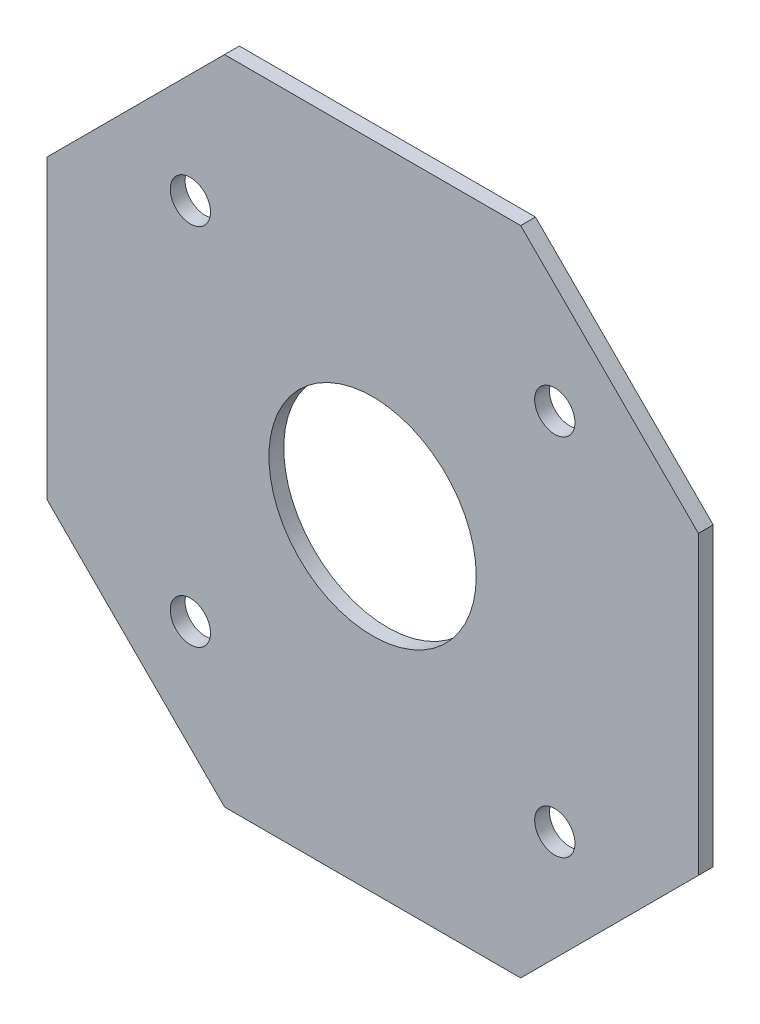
ISO-10303-21;
HEADER;
FILE_DESCRIPTION(('STEP AP214'),'2;1');
FILE_NAME('part.step','',(''),(''),'','','');
FILE_SCHEMA(('AUTOMOTIVE_DESIGN { 1 0 10303 214 1 1 1 1 }'));
ENDSEC;
DATA;
#1=APPLICATION_CONTEXT('core data for automotive mechanical design processes');
#2=APPLICATION_PROTOCOL_DEFINITION('international standard','automotive_design',2000,#1);
#3=PRODUCT_CONTEXT('',#1,'mechanical');
#4=PRODUCT('Part','Part','',(#3));
#5=PRODUCT_RELATED_PRODUCT_CATEGORY('part','',(#4));
#6=PRODUCT_DEFINITION_FORMATION('','',#4);
#7=PRODUCT_DEFINITION_CONTEXT('part definition',#1,'design');
#8=PRODUCT_DEFINITION('design','',#6,#7);
#9=PRODUCT_DEFINITION_SHAPE('','',#8);
#10=(LENGTH_UNIT() NAMED_UNIT(*) SI_UNIT(.MILLI.,.METRE.));
#11=(NAMED_UNIT(*) PLANE_ANGLE_UNIT() SI_UNIT($,.RADIAN.));
#12=(NAMED_UNIT(*) SI_UNIT($,.STERADIAN.) SOLID_ANGLE_UNIT());
#13=UNCERTAINTY_MEASURE_WITH_UNIT(LENGTH_MEASURE(1.E-05),#10,'distance_accuracy_value','');
#14=(GEOMETRIC_REPRESENTATION_CONTEXT(3) GLOBAL_UNCERTAINTY_ASSIGNED_CONTEXT((#13)) GLOBAL_UNIT_ASSIGNED_CONTEXT((#10,
#11,#12)) REPRESENTATION_CONTEXT('',''));
#15=CARTESIAN_POINT('',(0.,0.,0.));
#16=DIRECTION('',(0.,0.,1.));
#17=DIRECTION('',(1.,0.,0.));
#18=AXIS2_PLACEMENT_3D('',#15,#16,#17);
#19=CARTESIAN_POINT('',(-55.,55.,0.));
#20=DIRECTION('',(0.,0.,-1.));
#21=DIRECTION('',(-1.,0.,0.));
#22=AXIS2_PLACEMENT_3D('',#19,#20,#21);
#23=PLANE('',#22);
#24=CARTESIAN_POINT('',(-30.7591449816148,30.7591449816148,0.));
#25=DIRECTION('',(0.,0.,1.));
#26=DIRECTION('',(1.,0.,0.));
#27=AXIS2_PLACEMENT_3D('',#24,#25,#26);
#28=CIRCLE('',#27,3.4);
#29=CARTESIAN_POINT('',(-27.3591449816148,30.7591449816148,0.));
#30=VERTEX_POINT('',#29);
#31=EDGE_CURVE('E197',#30,#30,#28,.T.);
#32=ORIENTED_EDGE('',*,*,#31,.T.);
#33=EDGE_LOOP('',(#32));
#34=FACE_BOUND('',#33,.T.);
#35=CARTESIAN_POINT('',(-30.7591449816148,-30.7591449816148,0.));
#36=DIRECTION('',(0.,0.,1.));
#37=DIRECTION('',(1.,0.,0.));
#38=AXIS2_PLACEMENT_3D('',#35,#36,#37);
#39=CIRCLE('',#38,3.4);
#40=CARTESIAN_POINT('',(-27.3591449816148,-30.7591449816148,0.));
#41=VERTEX_POINT('',#40);
#42=EDGE_CURVE('E205',#41,#41,#39,.T.);
#43=ORIENTED_EDGE('',*,*,#42,.T.);
#44=EDGE_LOOP('',(#43));
#45=FACE_BOUND('',#44,.T.);
#46=CARTESIAN_POINT('',(30.7591449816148,-30.7591449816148,0.));
#47=DIRECTION('',(0.,0.,1.));
#48=DIRECTION('',(1.,0.,0.));
#49=AXIS2_PLACEMENT_3D('',#46,#47,#48);
#50=CIRCLE('',#49,3.4);
#51=CARTESIAN_POINT('',(34.1591449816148,-30.7591449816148,0.));
#52=VERTEX_POINT('',#51);
#53=EDGE_CURVE('E204',#52,#52,#50,.T.);
#54=ORIENTED_EDGE('',*,*,#53,.T.);
#55=EDGE_LOOP('',(#54));
#56=FACE_BOUND('',#55,.T.);
#57=DIRECTION('',(0.,1.,0.));
#58=VECTOR('',#57,1.);
#59=CARTESIAN_POINT('',(55.,-55.,0.));
#60=LINE('',#59,#58);
#61=CARTESIAN_POINT('',(55.,-25.,0.));
#62=VERTEX_POINT('',#61);
#63=CARTESIAN_POINT('',(55.,25.,0.));
#64=VERTEX_POINT('',#63);
#65=EDGE_CURVE('E134',#62,#64,#60,.T.);
#66=ORIENTED_EDGE('',*,*,#65,.F.);
#67=DIRECTION('',(0.707106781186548,0.707106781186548,0.));
#68=VECTOR('',#67,1.);
#69=CARTESIAN_POINT('',(40.,-39.9999999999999,0.));
#70=LINE('',#69,#68);
#71=CARTESIAN_POINT('',(25.,-55.,0.));
#72=VERTEX_POINT('',#71);
#73=EDGE_CURVE('E65',#62,#72,#70,.F.);
#74=ORIENTED_EDGE('',*,*,#73,.T.);
#75=DIRECTION('',(1.,0.,0.));
#76=VECTOR('',#75,1.);
#77=CARTESIAN_POINT('',(-55.,-55.,0.));
#78=LINE('',#77,#76);
#79=CARTESIAN_POINT('',(-25.,-55.,0.));
#80=VERTEX_POINT('',#79);
#81=EDGE_CURVE('E143',#80,#72,#78,.T.);
#82=ORIENTED_EDGE('',*,*,#81,.F.);
#83=DIRECTION('',(0.707106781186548,-0.707106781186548,0.));
#84=VECTOR('',#83,1.);
#85=CARTESIAN_POINT('',(-95.,15.,0.));
#86=LINE('',#85,#84);
#87=CARTESIAN_POINT('',(-55.,-25.,0.));
#88=VERTEX_POINT('',#87);
#89=EDGE_CURVE('E174',#80,#88,#86,.F.);
#90=ORIENTED_EDGE('',*,*,#89,.T.);
#91=DIRECTION('',(0.,-1.,0.));
#92=VECTOR('',#91,1.);
#93=CARTESIAN_POINT('',(-55.,-55.,0.));
#94=LINE('',#93,#92);
#95=CARTESIAN_POINT('',(-55.,25.,0.));
#96=VERTEX_POINT('',#95);
#97=EDGE_CURVE('E195',#96,#88,#94,.T.);
#98=ORIENTED_EDGE('',*,*,#97,.F.);
#99=DIRECTION('',(-0.707106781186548,-0.707106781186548,0.));
#100=VECTOR('',#99,1.);
#101=CARTESIAN_POINT('',(-40.,40.,0.));
#102=LINE('',#101,#100);
#103=CARTESIAN_POINT('',(-25.,55.,0.));
#104=VERTEX_POINT('',#103);
#105=EDGE_CURVE('E131',#96,#104,#102,.F.);
#106=ORIENTED_EDGE('',*,*,#105,.T.);
#107=DIRECTION('',(-1.,0.,0.));
#108=VECTOR('',#107,1.);
#109=CARTESIAN_POINT('',(-55.,55.,0.));
#110=LINE('',#109,#108);
#111=CARTESIAN_POINT('',(25.,55.,0.));
#112=VERTEX_POINT('',#111);
#113=EDGE_CURVE('E123',#112,#104,#110,.T.);
#114=ORIENTED_EDGE('',*,*,#113,.F.);
#115=DIRECTION('',(-0.707106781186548,0.707106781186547,0.));
#116=VECTOR('',#115,1.);
#117=CARTESIAN_POINT('',(-15.,95.,0.));
#118=LINE('',#117,#116);
#119=EDGE_CURVE('E109',#112,#64,#118,.F.);
#120=ORIENTED_EDGE('',*,*,#119,.T.);
#121=EDGE_LOOP('',(#66,#74,#82,#90,#98,#106,#114,#120));
#122=FACE_BOUND('',#121,.T.);
#123=CARTESIAN_POINT('',(0.,0.,0.));
#124=DIRECTION('',(0.,0.,1.));
#125=DIRECTION('',(1.,0.,0.));
#126=AXIS2_PLACEMENT_3D('',#123,#124,#125);
#127=CIRCLE('',#126,17.5);
#128=CARTESIAN_POINT('',(17.5,0.,0.));
#129=VERTEX_POINT('',#128);
#130=EDGE_CURVE('E227',#129,#129,#127,.T.);
#131=ORIENTED_EDGE('',*,*,#130,.T.);
#132=EDGE_LOOP('',(#131));
#133=FACE_BOUND('',#132,.T.);
#134=CARTESIAN_POINT('',(30.7591449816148,30.7591449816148,0.));
#135=DIRECTION('',(0.,0.,1.));
#136=DIRECTION('',(1.,0.,0.));
#137=AXIS2_PLACEMENT_3D('',#134,#135,#136);
#138=CIRCLE('',#137,3.4);
#139=CARTESIAN_POINT('',(34.1591449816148,30.7591449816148,0.));
#140=VERTEX_POINT('',#139);
#141=EDGE_CURVE('E192',#140,#140,#138,.T.);
#142=ORIENTED_EDGE('',*,*,#141,.T.);
#143=EDGE_LOOP('',(#142));
#144=FACE_BOUND('',#143,.T.);
#145=ADVANCED_FACE('F42',(#34,#45,#56,#122,#133,#144),#23,.T.);
#146=CARTESIAN_POINT('',(-55.,-55.,2.5));
#147=DIRECTION('',(1.,0.,0.));
#148=DIRECTION('',(0.,0.,-1.));
#149=AXIS2_PLACEMENT_3D('',#146,#147,#148);
#150=PLANE('',#149);
#151=ORIENTED_EDGE('',*,*,#97,.T.);
#152=DIRECTION('',(0.,0.,1.));
#153=VECTOR('',#152,1.);
#154=CARTESIAN_POINT('',(-55.,-25.,2.5));
#155=LINE('',#154,#153);
#156=CARTESIAN_POINT('',(-55.,-25.,2.5));
#157=VERTEX_POINT('',#156);
#158=EDGE_CURVE('E177',#88,#157,#155,.T.);
#159=ORIENTED_EDGE('',*,*,#158,.T.);
#160=DIRECTION('',(0.,-1.,0.));
#161=VECTOR('',#160,1.);
#162=CARTESIAN_POINT('',(-55.,-55.,2.5));
#163=LINE('',#162,#161);
#164=CARTESIAN_POINT('',(-55.,25.,2.5));
#165=VERTEX_POINT('',#164);
#166=EDGE_CURVE('E133',#165,#157,#163,.T.);
#167=ORIENTED_EDGE('',*,*,#166,.F.);
#168=DIRECTION('',(0.,0.,-1.));
#169=VECTOR('',#168,1.);
#170=CARTESIAN_POINT('',(-55.,25.,2.5));
#171=LINE('',#170,#169);
#172=EDGE_CURVE('E158',#165,#96,#171,.T.);
#173=ORIENTED_EDGE('',*,*,#172,.T.);
#174=EDGE_LOOP('',(#151,#159,#167,#173));
#175=FACE_BOUND('',#174,.T.);
#176=ADVANCED_FACE('F44',(#175),#150,.F.);
#177=CARTESIAN_POINT('',(-55.,-55.,2.5));
#178=DIRECTION('',(0.,1.,0.));
#179=DIRECTION('',(0.,0.,1.));
#180=AXIS2_PLACEMENT_3D('',#177,#178,#179);
#181=PLANE('',#180);
#182=ORIENTED_EDGE('',*,*,#81,.T.);
#183=DIRECTION('',(0.,0.,1.));
#184=VECTOR('',#183,1.);
#185=CARTESIAN_POINT('',(25.,-55.,2.5));
#186=LINE('',#185,#184);
#187=CARTESIAN_POINT('',(25.,-55.,2.5));
#188=VERTEX_POINT('',#187);
#189=EDGE_CURVE('E51',#72,#188,#186,.T.);
#190=ORIENTED_EDGE('',*,*,#189,.T.);
#191=DIRECTION('',(1.,0.,0.));
#192=VECTOR('',#191,1.);
#193=CARTESIAN_POINT('',(-55.,-55.,2.5));
#194=LINE('',#193,#192);
#195=CARTESIAN_POINT('',(-25.,-55.,2.5));
#196=VERTEX_POINT('',#195);
#197=EDGE_CURVE('E140',#196,#188,#194,.T.);
#198=ORIENTED_EDGE('',*,*,#197,.F.);
#199=DIRECTION('',(0.,0.,-1.));
#200=VECTOR('',#199,1.);
#201=CARTESIAN_POINT('',(-25.,-55.,2.5));
#202=LINE('',#201,#200);
#203=EDGE_CURVE('E170',#196,#80,#202,.T.);
#204=ORIENTED_EDGE('',*,*,#203,.T.);
#205=EDGE_LOOP('',(#182,#190,#198,#204));
#206=FACE_BOUND('',#205,.T.);
#207=ADVANCED_FACE('F245',(#206),#181,.F.);
#208=CARTESIAN_POINT('',(55.,-55.,2.5));
#209=DIRECTION('',(-1.,0.,0.));
#210=DIRECTION('',(0.,-1.,0.));
#211=AXIS2_PLACEMENT_3D('',#208,#209,#210);
#212=PLANE('',#211);
#213=DIRECTION('',(0.,1.,0.));
#214=VECTOR('',#213,1.);
#215=CARTESIAN_POINT('',(55.,-55.,2.5));
#216=LINE('',#215,#214);
#217=CARTESIAN_POINT('',(55.,-25.,2.5));
#218=VERTEX_POINT('',#217);
#219=CARTESIAN_POINT('',(55.,25.,2.5));
#220=VERTEX_POINT('',#219);
#221=EDGE_CURVE('E148',#218,#220,#216,.T.);
#222=ORIENTED_EDGE('',*,*,#221,.F.);
#223=DIRECTION('',(0.,0.,-1.));
#224=VECTOR('',#223,1.);
#225=CARTESIAN_POINT('',(55.,-25.,2.5));
#226=LINE('',#225,#224);
#227=EDGE_CURVE('E183',#218,#62,#226,.T.);
#228=ORIENTED_EDGE('',*,*,#227,.T.);
#229=ORIENTED_EDGE('',*,*,#65,.T.);
#230=DIRECTION('',(0.,0.,1.));
#231=VECTOR('',#230,1.);
#232=CARTESIAN_POINT('',(55.,25.,2.5));
#233=LINE('',#232,#231);
#234=EDGE_CURVE('E115',#64,#220,#233,.T.);
#235=ORIENTED_EDGE('',*,*,#234,.T.);
#236=EDGE_LOOP('',(#222,#228,#229,#235));
#237=FACE_BOUND('',#236,.T.);
#238=ADVANCED_FACE('F251',(#237),#212,.F.);
#239=CARTESIAN_POINT('',(-55.,55.,2.5));
#240=DIRECTION('',(0.,-1.,0.));
#241=DIRECTION('',(0.,0.,-1.));
#242=AXIS2_PLACEMENT_3D('',#239,#240,#241);
#243=PLANE('',#242);
#244=ORIENTED_EDGE('',*,*,#113,.T.);
#245=DIRECTION('',(0.,0.,1.));
#246=VECTOR('',#245,1.);
#247=CARTESIAN_POINT('',(-25.,55.,2.5));
#248=LINE('',#247,#246);
#249=CARTESIAN_POINT('',(-25.,55.,2.5));
#250=VERTEX_POINT('',#249);
#251=EDGE_CURVE('E164',#104,#250,#248,.T.);
#252=ORIENTED_EDGE('',*,*,#251,.T.);
#253=DIRECTION('',(-1.,0.,0.));
#254=VECTOR('',#253,1.);
#255=CARTESIAN_POINT('',(-55.,55.,2.5));
#256=LINE('',#255,#254);
#257=CARTESIAN_POINT('',(25.,55.,2.5));
#258=VERTEX_POINT('',#257);
#259=EDGE_CURVE('E126',#258,#250,#256,.T.);
#260=ORIENTED_EDGE('',*,*,#259,.F.);
#261=DIRECTION('',(0.,0.,-1.));
#262=VECTOR('',#261,1.);
#263=CARTESIAN_POINT('',(25.,55.,2.5));
#264=LINE('',#263,#262);
#265=EDGE_CURVE('E113',#258,#112,#264,.T.);
#266=ORIENTED_EDGE('',*,*,#265,.T.);
#267=EDGE_LOOP('',(#244,#252,#260,#266));
#268=FACE_BOUND('',#267,.T.);
#269=ADVANCED_FACE('F122',(#268),#243,.F.);
#270=CARTESIAN_POINT('',(-55.,55.,2.5));
#271=DIRECTION('',(0.,0.,-1.));
#272=DIRECTION('',(-1.,0.,0.));
#273=AXIS2_PLACEMENT_3D('',#270,#271,#272);
#274=PLANE('',#273);
#275=CARTESIAN_POINT('',(-30.7591449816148,30.7591449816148,2.5));
#276=DIRECTION('',(0.,0.,1.));
#277=DIRECTION('',(1.,0.,0.));
#278=AXIS2_PLACEMENT_3D('',#275,#276,#277);
#279=CIRCLE('',#278,3.4);
#280=CARTESIAN_POINT('',(-27.3591449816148,30.7591449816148,2.5));
#281=VERTEX_POINT('',#280);
#282=EDGE_CURVE('E199',#281,#281,#279,.T.);
#283=ORIENTED_EDGE('',*,*,#282,.F.);
#284=EDGE_LOOP('',(#283));
#285=FACE_BOUND('',#284,.T.);
#286=CARTESIAN_POINT('',(-30.7591449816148,-30.7591449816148,2.5));
#287=DIRECTION('',(0.,0.,1.));
#288=DIRECTION('',(1.,0.,0.));
#289=AXIS2_PLACEMENT_3D('',#286,#287,#288);
#290=CIRCLE('',#289,3.4);
#291=CARTESIAN_POINT('',(-27.3591449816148,-30.7591449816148,2.5));
#292=VERTEX_POINT('',#291);
#293=EDGE_CURVE('E202',#292,#292,#290,.T.);
#294=ORIENTED_EDGE('',*,*,#293,.F.);
#295=EDGE_LOOP('',(#294));
#296=FACE_BOUND('',#295,.T.);
#297=CARTESIAN_POINT('',(30.7591449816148,-30.7591449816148,2.5));
#298=DIRECTION('',(0.,0.,1.));
#299=DIRECTION('',(1.,0.,0.));
#300=AXIS2_PLACEMENT_3D('',#297,#298,#299);
#301=CIRCLE('',#300,3.4);
#302=CARTESIAN_POINT('',(34.1591449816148,-30.7591449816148,2.5));
#303=VERTEX_POINT('',#302);
#304=EDGE_CURVE('E211',#303,#303,#301,.T.);
#305=ORIENTED_EDGE('',*,*,#304,.F.);
#306=EDGE_LOOP('',(#305));
#307=FACE_BOUND('',#306,.T.);
#308=CARTESIAN_POINT('',(30.7591449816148,30.7591449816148,2.5));
#309=DIRECTION('',(0.,0.,1.));
#310=DIRECTION('',(1.,0.,0.));
#311=AXIS2_PLACEMENT_3D('',#308,#309,#310);
#312=CIRCLE('',#311,3.4);
#313=CARTESIAN_POINT('',(34.1591449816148,30.7591449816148,2.5));
#314=VERTEX_POINT('',#313);
#315=EDGE_CURVE('E189',#314,#314,#312,.T.);
#316=ORIENTED_EDGE('',*,*,#315,.F.);
#317=EDGE_LOOP('',(#316));
#318=FACE_BOUND('',#317,.T.);
#319=CARTESIAN_POINT('',(0.,0.,2.5));
#320=DIRECTION('',(0.,0.,1.));
#321=DIRECTION('',(1.,0.,0.));
#322=AXIS2_PLACEMENT_3D('',#319,#320,#321);
#323=CIRCLE('',#322,17.5);
#324=CARTESIAN_POINT('',(17.5,0.,2.5));
#325=VERTEX_POINT('',#324);
#326=EDGE_CURVE('E191',#325,#325,#323,.T.);
#327=ORIENTED_EDGE('',*,*,#326,.F.);
#328=EDGE_LOOP('',(#327));
#329=FACE_BOUND('',#328,.T.);
#330=ORIENTED_EDGE('',*,*,#197,.T.);
#331=DIRECTION('',(-0.707106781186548,-0.707106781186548,0.));
#332=VECTOR('',#331,1.);
#333=CARTESIAN_POINT('',(55.,-25.,2.5));
#334=LINE('',#333,#332);
#335=EDGE_CURVE('E11',#188,#218,#334,.F.);
#336=ORIENTED_EDGE('',*,*,#335,.T.);
#337=ORIENTED_EDGE('',*,*,#221,.T.);
#338=DIRECTION('',(0.707106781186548,-0.707106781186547,0.));
#339=VECTOR('',#338,1.);
#340=CARTESIAN_POINT('',(25.,55.,2.5));
#341=LINE('',#340,#339);
#342=EDGE_CURVE('E155',#220,#258,#341,.F.);
#343=ORIENTED_EDGE('',*,*,#342,.T.);
#344=ORIENTED_EDGE('',*,*,#259,.T.);
#345=DIRECTION('',(0.707106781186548,0.707106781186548,0.));
#346=VECTOR('',#345,1.);
#347=CARTESIAN_POINT('',(-55.,25.,2.5));
#348=LINE('',#347,#346);
#349=EDGE_CURVE('E167',#250,#165,#348,.F.);
#350=ORIENTED_EDGE('',*,*,#349,.T.);
#351=ORIENTED_EDGE('',*,*,#166,.T.);
#352=DIRECTION('',(-0.707106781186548,0.707106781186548,0.));
#353=VECTOR('',#352,1.);
#354=CARTESIAN_POINT('',(-25.,-55.,2.5));
#355=LINE('',#354,#353);
#356=EDGE_CURVE('E180',#157,#196,#355,.F.);
#357=ORIENTED_EDGE('',*,*,#356,.T.);
#358=EDGE_LOOP('',(#330,#336,#337,#343,#344,#350,#351,#357));
#359=FACE_BOUND('',#358,.T.);
#360=ADVANCED_FACE('F243',(#285,#296,#307,#318,#329,#359),#274,.F.);
#361=CARTESIAN_POINT('',(25.,55.,2.5));
#362=DIRECTION('',(-0.707106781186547,-0.707106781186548,0.));
#363=DIRECTION('',(0.707106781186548,-0.707106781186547,0.));
#364=AXIS2_PLACEMENT_3D('',#361,#362,#363);
#365=PLANE('',#364);
#366=ORIENTED_EDGE('',*,*,#342,.F.);
#367=ORIENTED_EDGE('',*,*,#234,.F.);
#368=ORIENTED_EDGE('',*,*,#119,.F.);
#369=ORIENTED_EDGE('',*,*,#265,.F.);
#370=EDGE_LOOP('',(#366,#367,#368,#369));
#371=FACE_BOUND('',#370,.T.);
#372=ADVANCED_FACE('F112',(#371),#365,.F.);
#373=CARTESIAN_POINT('',(-55.,25.,2.5));
#374=DIRECTION('',(0.707106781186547,-0.707106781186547,0.));
#375=DIRECTION('',(0.707106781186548,0.707106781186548,0.));
#376=AXIS2_PLACEMENT_3D('',#373,#374,#375);
#377=PLANE('',#376);
#378=ORIENTED_EDGE('',*,*,#349,.F.);
#379=ORIENTED_EDGE('',*,*,#251,.F.);
#380=ORIENTED_EDGE('',*,*,#105,.F.);
#381=ORIENTED_EDGE('',*,*,#172,.F.);
#382=EDGE_LOOP('',(#378,#379,#380,#381));
#383=FACE_BOUND('',#382,.T.);
#384=ADVANCED_FACE('F254',(#383),#377,.F.);
#385=CARTESIAN_POINT('',(-25.,-55.,2.5));
#386=DIRECTION('',(0.707106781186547,0.707106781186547,0.));
#387=DIRECTION('',(-0.707106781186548,0.707106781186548,0.));
#388=AXIS2_PLACEMENT_3D('',#385,#386,#387);
#389=PLANE('',#388);
#390=ORIENTED_EDGE('',*,*,#356,.F.);
#391=ORIENTED_EDGE('',*,*,#158,.F.);
#392=ORIENTED_EDGE('',*,*,#89,.F.);
#393=ORIENTED_EDGE('',*,*,#203,.F.);
#394=EDGE_LOOP('',(#390,#391,#392,#393));
#395=FACE_BOUND('',#394,.T.);
#396=ADVANCED_FACE('F240',(#395),#389,.F.);
#397=CARTESIAN_POINT('',(55.,-25.,2.5));
#398=DIRECTION('',(-0.707106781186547,0.707106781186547,0.));
#399=DIRECTION('',(-0.707106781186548,-0.707106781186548,0.));
#400=AXIS2_PLACEMENT_3D('',#397,#398,#399);
#401=PLANE('',#400);
#402=ORIENTED_EDGE('',*,*,#335,.F.);
#403=ORIENTED_EDGE('',*,*,#189,.F.);
#404=ORIENTED_EDGE('',*,*,#73,.F.);
#405=ORIENTED_EDGE('',*,*,#227,.F.);
#406=EDGE_LOOP('',(#402,#403,#404,#405));
#407=FACE_BOUND('',#406,.T.);
#408=ADVANCED_FACE('F247',(#407),#401,.F.);
#409=CARTESIAN_POINT('',(0.,0.,0.));
#410=DIRECTION('',(0.,0.,1.));
#411=DIRECTION('',(1.,0.,0.));
#412=AXIS2_PLACEMENT_3D('',#409,#410,#411);
#413=CYLINDRICAL_SURFACE('',#412,17.5);
#414=ORIENTED_EDGE('',*,*,#130,.F.);
#415=EDGE_LOOP('',(#414));
#416=FACE_BOUND('',#415,.T.);
#417=ORIENTED_EDGE('',*,*,#326,.T.);
#418=EDGE_LOOP('',(#417));
#419=FACE_BOUND('',#418,.T.);
#420=ADVANCED_FACE('F314',(#416,#419),#413,.F.);
#421=CARTESIAN_POINT('',(30.7591449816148,30.7591449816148,2.5));
#422=DIRECTION('',(0.,0.,1.));
#423=DIRECTION('',(1.,0.,0.));
#424=AXIS2_PLACEMENT_3D('',#421,#422,#423);
#425=CYLINDRICAL_SURFACE('',#424,3.4);
#426=ORIENTED_EDGE('',*,*,#141,.F.);
#427=EDGE_LOOP('',(#426));
#428=FACE_BOUND('',#427,.T.);
#429=ORIENTED_EDGE('',*,*,#315,.T.);
#430=EDGE_LOOP('',(#429));
#431=FACE_BOUND('',#430,.T.);
#432=ADVANCED_FACE('F322',(#428,#431),#425,.F.);
#433=CARTESIAN_POINT('',(30.7591449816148,-30.7591449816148,2.5));
#434=DIRECTION('',(0.,0.,1.));
#435=DIRECTION('',(1.,0.,0.));
#436=AXIS2_PLACEMENT_3D('',#433,#434,#435);
#437=CYLINDRICAL_SURFACE('',#436,3.4);
#438=ORIENTED_EDGE('',*,*,#53,.F.);
#439=EDGE_LOOP('',(#438));
#440=FACE_BOUND('',#439,.T.);
#441=ORIENTED_EDGE('',*,*,#304,.T.);
#442=EDGE_LOOP('',(#441));
#443=FACE_BOUND('',#442,.T.);
#444=ADVANCED_FACE('F332',(#440,#443),#437,.F.);
#445=CARTESIAN_POINT('',(-30.7591449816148,-30.7591449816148,2.5));
#446=DIRECTION('',(0.,0.,1.));
#447=DIRECTION('',(1.,0.,0.));
#448=AXIS2_PLACEMENT_3D('',#445,#446,#447);
#449=CYLINDRICAL_SURFACE('',#448,3.4);
#450=ORIENTED_EDGE('',*,*,#42,.F.);
#451=EDGE_LOOP('',(#450));
#452=FACE_BOUND('',#451,.T.);
#453=ORIENTED_EDGE('',*,*,#293,.T.);
#454=EDGE_LOOP('',(#453));
#455=FACE_BOUND('',#454,.T.);
#456=ADVANCED_FACE('F342',(#452,#455),#449,.F.);
#457=CARTESIAN_POINT('',(-30.7591449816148,30.7591449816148,2.5));
#458=DIRECTION('',(0.,0.,1.));
#459=DIRECTION('',(1.,0.,0.));
#460=AXIS2_PLACEMENT_3D('',#457,#458,#459);
#461=CYLINDRICAL_SURFACE('',#460,3.4);
#462=ORIENTED_EDGE('',*,*,#31,.F.);
#463=EDGE_LOOP('',(#462));
#464=FACE_BOUND('',#463,.T.);
#465=ORIENTED_EDGE('',*,*,#282,.T.);
#466=EDGE_LOOP('',(#465));
#467=FACE_BOUND('',#466,.T.);
#468=ADVANCED_FACE('F352',(#464,#467),#461,.F.);
#469=CLOSED_SHELL('',(#145,#176,#207,#238,#269,#360,#372,#384,#396,#408,#420,#432,#444,#456,#468));
#470=MANIFOLD_SOLID_BREP('B2',#469);
#471=ADVANCED_BREP_SHAPE_REPRESENTATION('',(#18,#470),#14);
#472=SHAPE_DEFINITION_REPRESENTATION(#9,#471);
ENDSEC;
END-ISO-10303-21;
